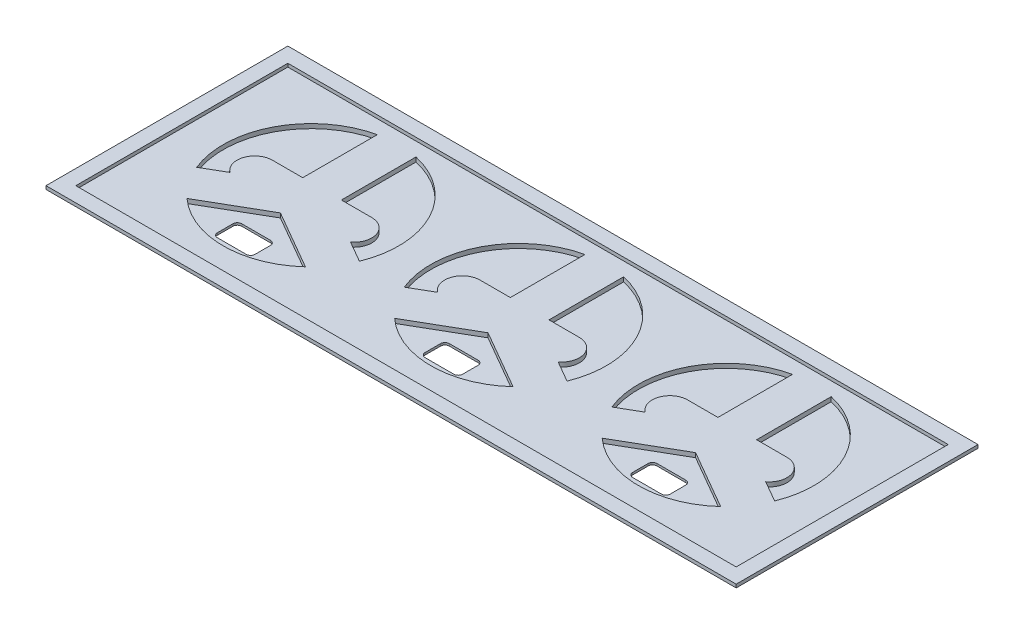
from build123d import *

# Parameters (mm, degrees)
SKETCH1_W               = 303
SKETCH1_H               = 100
BOSS_EXTRUDE1_DEPTH     = 3
SKETCH2_W               = 303
SKETCH2_H               = 100
SKETCH2_W_2             = 299
SKETCH2_H_2             = 96
BOSS_EXTRUDE3_DEPTH     = 1.5
SKETCH3_W               = 100
SKETCH3_H               = 1.5
BOSS_EXTRUDE4_DEPTH     = 4.75
CUT_EXTRUDE2_DEPTH      = 2
CUT_EXTRUDE3_DEPTH      = 165.092390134
CUT_EXTRUDE3_DEPTH_BACK = 165.092390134
SKETCH7_W               = 312.5
SKETCH7_H               = 1.5
BOSS_EXTRUDE5_DEPTH     = 4.75
BOSS_EXTRUDE6_DEPTH     = 2


with BuildPart() as part:
    # Sketch1 → Boss-Extrude1 (new body)
    with BuildSketch(Plane(origin=(0, 0, 0), x_dir=(1, 0, 0), z_dir=(0, 1, 0))):
        Rectangle(SKETCH1_W, SKETCH1_H)
    extrude(amount=BOSS_EXTRUDE1_DEPTH)

    # Sketch2 → Boss-Extrude3 (add)
    with BuildSketch(Plane(origin=(0, 3, 0), x_dir=(1, 0, 0), z_dir=(0, 1, 0))):
        Rectangle(SKETCH2_W, SKETCH2_H)
        Rectangle(SKETCH2_W_2, SKETCH2_H_2, mode=Mode.SUBTRACT)
    extrude(amount=BOSS_EXTRUDE3_DEPTH)

    # Sketch3 → Boss-Extrude4 (add)
    with BuildSketch(Plane(origin=(151.5, 0, 0), x_dir=(0, 0, -1), z_dir=(1, 0, 0))):
        with Locations((0, 3.75)):
            Rectangle(SKETCH3_W, SKETCH3_H)
    boss_extrude4 = extrude(amount=BOSS_EXTRUDE4_DEPTH)

    # Sketch5 → Cut-Extrude2 (cut)
    with BuildSketch(Plane(origin=(0, 3, 0), x_dir=(1, 0, 0), z_dir=(0, 1, 0))):
        with BuildLine():
            Line((-85.25, 4.294991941), (-57.15793626, -11.923968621))
            ThreePointArc((-57.15793626, -11.923968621), (-54.983756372, -4.602317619), (-54.25, 3))
            ThreePointArc((-54.25, 3), (-62.952657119, 27.821865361), (-85.25, 41.774991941))
            Line((-85.25, 41.774991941), (-85.25, 4.294991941))
        make_face()
        with BuildLine():
            ThreePointArc((-102.75, 41.774991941), (-129.221494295, 21.425765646), (-130.84206374, -11.923968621))
            Line((-130.84206374, -11.923968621), (-102.75, 4.294991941))
            Line((-102.75, 4.294991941), (-102.75, 41.774991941))
        make_face()
        with BuildLine():
            ThreePointArc((-120.815679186, -26.342492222), (-94, -36.75), (-67.184320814, -26.342492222))
            Line((-67.184320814, -26.342492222), (-94, -10.860452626))
            Line((-94, -10.860452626), (-120.815679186, -26.342492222))
        make_face()
        with BuildLine():
            ThreePointArc((-8.75, 41.774991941), (-35.221494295, 21.425765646), (-36.84206374, -11.923968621))
            Line((-36.84206374, -11.923968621), (-8.75, 4.294991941))
            Line((-8.75, 4.294991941), (-8.75, 41.774991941))
        make_face()
        with BuildLine():
            ThreePointArc((-26.815679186, -26.342492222), (0, -36.75), (26.815679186, -26.342492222))
            Line((26.815679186, -26.342492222), (0, -10.860452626))
            Line((0, -10.860452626), (-26.815679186, -26.342492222))
        make_face()
        with BuildLine():
            Line((8.75, 4.294991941), (36.84206374, -11.923968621))
            ThreePointArc((36.84206374, -11.923968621), (39.016243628, -4.602317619), (39.75, 3))
            ThreePointArc((39.75, 3), (31.047342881, 27.821865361), (8.75, 41.774991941))
            Line((8.75, 41.774991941), (8.75, 4.294991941))
        make_face()
        with BuildLine():
            ThreePointArc((133.75, 3), (125.047342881, 27.821865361), (102.75, 41.774991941))
            Line((102.75, 41.774991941), (102.75, 4.294991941))
            Line((102.75, 4.294991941), (130.84206374, -11.923968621))
            ThreePointArc((130.84206374, -11.923968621), (133.016243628, -4.602317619), (133.75, 3))
        make_face()
        with BuildLine():
            ThreePointArc((67.184320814, -26.342492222), (94, -36.75), (120.815679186, -26.342492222))
            Line((120.815679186, -26.342492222), (94, -10.860452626))
            Line((94, -10.860452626), (67.184320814, -26.342492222))
        make_face()
        with BuildLine():
            Line((85.25, 4.294991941), (85.25, 41.774991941))
            ThreePointArc((85.25, 41.774991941), (58.778505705, 21.425765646), (57.15793626, -11.923968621))
            Line((57.15793626, -11.923968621), (85.25, 4.294991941))
        make_face()
    extrude(amount=-CUT_EXTRUDE2_DEPTH, mode=Mode.SUBTRACT)

    # Sketch6 → Cut-Extrude3 (cut, two sides: drawn at the far end of the back side and taken through both)
    with BuildSketch(Plane(origin=(0, 1, 0), x_dir=(1, 0, 0), z_dir=(0, 1, 0)).offset(-CUT_EXTRUDE3_DEPTH_BACK)):
        with BuildLine():
            Line((-6.5, -21.860452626), (6.5, -21.860452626))
            ThreePointArc((6.5, -21.860452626), (7.914213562, -22.446239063), (8.5, -23.860452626))
            Line((8.5, -23.860452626), (8.5, -30.860452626))
            ThreePointArc((8.5, -30.860452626), (7.914213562, -32.274666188), (6.5, -32.860452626))
            Line((6.5, -32.860452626), (-6.5, -32.860452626))
            ThreePointArc((-6.5, -32.860452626), (-7.914213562, -32.274666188), (-8.5, -30.860452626))
            Line((-8.5, -30.860452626), (-8.5, -23.860452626))
            ThreePointArc((-8.5, -23.860452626), (-7.914213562, -22.446239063), (-6.5, -21.860452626))
        make_face()
        with BuildLine():
            Line((-100.5, -21.860452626), (-87.5, -21.860452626))
            ThreePointArc((-87.5, -21.860452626), (-86.085786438, -22.446239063), (-85.5, -23.860452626))
            Line((-85.5, -23.860452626), (-85.5, -30.860452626))
            ThreePointArc((-85.5, -30.860452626), (-86.085786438, -32.274666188), (-87.5, -32.860452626))
            Line((-87.5, -32.860452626), (-100.5, -32.860452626))
            ThreePointArc((-100.5, -32.860452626), (-101.914213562, -32.274666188), (-102.5, -30.860452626))
            Line((-102.5, -30.860452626), (-102.5, -23.860452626))
            ThreePointArc((-102.5, -23.860452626), (-101.914213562, -22.446239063), (-100.5, -21.860452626))
        make_face()
        with BuildLine():
            Line((87.5, -21.860452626), (100.5, -21.860452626))
            ThreePointArc((100.5, -21.860452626), (101.914213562, -22.446239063), (102.5, -23.860452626))
            Line((102.5, -23.860452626), (102.5, -30.860452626))
            ThreePointArc((102.5, -30.860452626), (101.914213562, -32.274666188), (100.5, -32.860452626))
            Line((100.5, -32.860452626), (87.5, -32.860452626))
            ThreePointArc((87.5, -32.860452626), (86.085786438, -32.274666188), (85.5, -30.860452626))
            Line((85.5, -30.860452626), (85.5, -23.860452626))
            ThreePointArc((85.5, -23.860452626), (86.085786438, -22.446239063), (87.5, -21.860452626))
        make_face()
    extrude(amount=CUT_EXTRUDE3_DEPTH + CUT_EXTRUDE3_DEPTH_BACK, mode=Mode.SUBTRACT)

    # Mirror1: Boss-Extrude4 across plane
    add(boss_extrude4.mirror(Plane(origin=(0, 0, 0), x_dir=(0, 0, 1), z_dir=(1, 0, 0))))

    # Sketch7 → Boss-Extrude5 (add)
    with BuildSketch(Plane.XY.offset(50)):
        with Locations((0, 3.75)):
            Rectangle(SKETCH7_W, SKETCH7_H)
    boss_extrude5 = extrude(amount=BOSS_EXTRUDE5_DEPTH)

    # Mirror2: Boss-Extrude5 across plane
    add(boss_extrude5.mirror(Plane.XY))

    # Sketch8 → Boss-Extrude6 (add)
    with BuildSketch(Plane(origin=(0, 3, 0), x_dir=(1, 0, 0), z_dir=(0, 1, 0))):
        with BuildLine():
            Line((-22.5, 8), (22.5, 8))
            ThreePointArc((22.5, 8), (30.5, 0), (22.5, -8))
            Line((22.5, -8), (-22.5, -8))
            ThreePointArc((-22.5, -8), (-30.5, 0), (-22.5, 8))
        make_face()
        with BuildLine():
            Line((116.5, 8), (71.5, 8))
            ThreePointArc((71.5, 8), (63.5, 0), (71.5, -8))
            Line((71.5, -8), (116.5, -8))
            ThreePointArc((116.5, -8), (124.5, 0), (116.5, 8))
        make_face()
        with BuildLine():
            Line((-71.5, 8), (-116.5, 8))
            ThreePointArc((-116.5, 8), (-124.5, 0), (-116.5, -8))
            Line((-116.5, -8), (-71.5, -8))
            ThreePointArc((-71.5, -8), (-63.5, 0), (-71.5, 8))
        make_face()
    extrude(amount=-BOSS_EXTRUDE6_DEPTH)


solid = part.part
